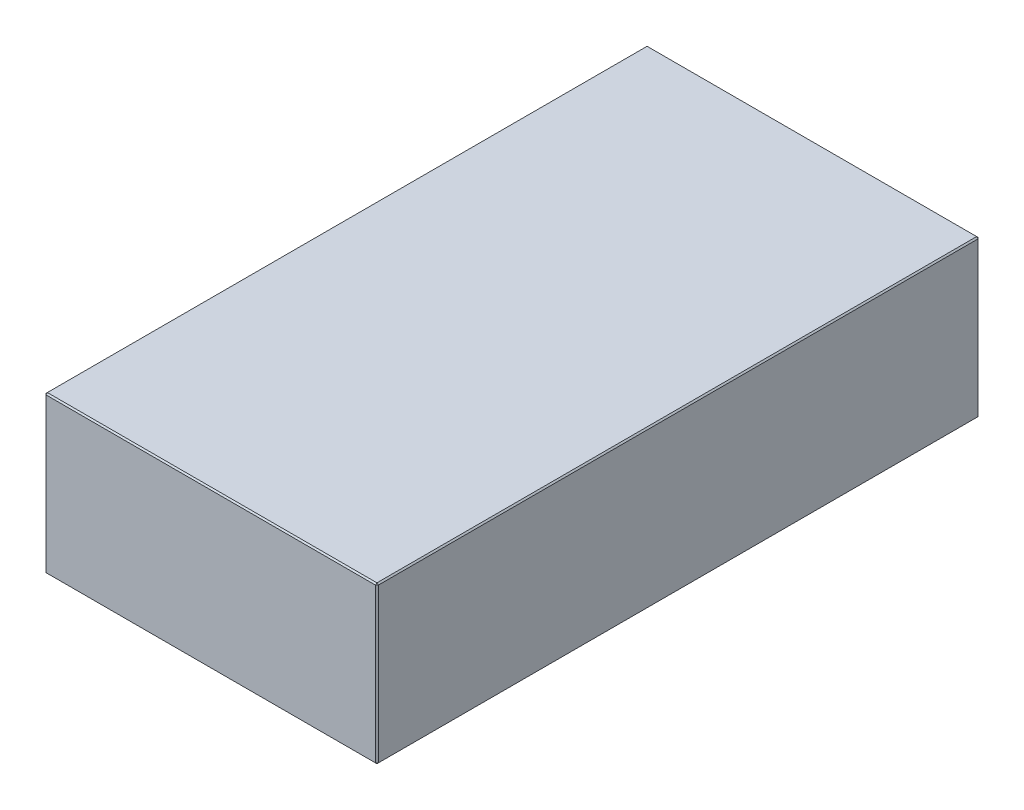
ISO-10303-21;
HEADER;
FILE_DESCRIPTION(('STEP AP214'),'2;1');
FILE_NAME('part.step','',(''),(''),'','','');
FILE_SCHEMA(('AUTOMOTIVE_DESIGN { 1 0 10303 214 1 1 1 1 }'));
ENDSEC;
DATA;
#1=APPLICATION_CONTEXT('core data for automotive mechanical design processes');
#2=APPLICATION_PROTOCOL_DEFINITION('international standard','automotive_design',2000,#1);
#3=PRODUCT_CONTEXT('',#1,'mechanical');
#4=PRODUCT('Part','Part','',(#3));
#5=PRODUCT_RELATED_PRODUCT_CATEGORY('part','',(#4));
#6=PRODUCT_DEFINITION_FORMATION('','',#4);
#7=PRODUCT_DEFINITION_CONTEXT('part definition',#1,'design');
#8=PRODUCT_DEFINITION('design','',#6,#7);
#9=PRODUCT_DEFINITION_SHAPE('','',#8);
#10=(LENGTH_UNIT() NAMED_UNIT(*) SI_UNIT(.MILLI.,.METRE.));
#11=(NAMED_UNIT(*) PLANE_ANGLE_UNIT() SI_UNIT($,.RADIAN.));
#12=(NAMED_UNIT(*) SI_UNIT($,.STERADIAN.) SOLID_ANGLE_UNIT());
#13=UNCERTAINTY_MEASURE_WITH_UNIT(LENGTH_MEASURE(1.E-05),#10,'distance_accuracy_value','');
#14=(GEOMETRIC_REPRESENTATION_CONTEXT(3) GLOBAL_UNCERTAINTY_ASSIGNED_CONTEXT((#13)) GLOBAL_UNIT_ASSIGNED_CONTEXT((#10,
#11,#12)) REPRESENTATION_CONTEXT('',''));
#15=CARTESIAN_POINT('',(0.,0.,0.));
#16=DIRECTION('',(0.,0.,1.));
#17=DIRECTION('',(1.,0.,0.));
#18=AXIS2_PLACEMENT_3D('',#15,#16,#17);
#19=CARTESIAN_POINT('',(-123.,116.,223.));
#20=DIRECTION('',(1.,0.,0.));
#21=DIRECTION('',(0.,0.,-1.));
#22=AXIS2_PLACEMENT_3D('',#19,#20,#21);
#23=PLANE('',#22);
#24=DIRECTION('',(0.,-1.,0.));
#25=VECTOR('',#24,1.);
#26=CARTESIAN_POINT('',(-123.,116.,-222.));
#27=LINE('',#26,#25);
#28=CARTESIAN_POINT('',(-123.,115.,-222.));
#29=VERTEX_POINT('',#28);
#30=CARTESIAN_POINT('',(-123.,0.999999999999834,-222.));
#31=VERTEX_POINT('',#30);
#32=EDGE_CURVE('E114',#29,#31,#27,.T.);
#33=ORIENTED_EDGE('',*,*,#32,.T.);
#34=DIRECTION('',(0.,0.,1.));
#35=VECTOR('',#34,1.);
#36=CARTESIAN_POINT('',(-123.,0.999999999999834,223.));
#37=LINE('',#36,#35);
#38=CARTESIAN_POINT('',(-123.,0.999999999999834,222.));
#39=VERTEX_POINT('',#38);
#40=EDGE_CURVE('E110',#31,#39,#37,.T.);
#41=ORIENTED_EDGE('',*,*,#40,.T.);
#42=DIRECTION('',(0.,1.,0.));
#43=VECTOR('',#42,1.);
#44=CARTESIAN_POINT('',(-123.,116.,222.));
#45=LINE('',#44,#43);
#46=CARTESIAN_POINT('',(-123.,115.,222.));
#47=VERTEX_POINT('',#46);
#48=EDGE_CURVE('E103',#39,#47,#45,.T.);
#49=ORIENTED_EDGE('',*,*,#48,.T.);
#50=DIRECTION('',(0.,0.,-1.));
#51=VECTOR('',#50,1.);
#52=CARTESIAN_POINT('',(-123.,115.,-223.));
#53=LINE('',#52,#51);
#54=EDGE_CURVE('E107',#47,#29,#53,.T.);
#55=ORIENTED_EDGE('',*,*,#54,.T.);
#56=EDGE_LOOP('',(#33,#41,#49,#55));
#57=FACE_BOUND('',#56,.T.);
#58=ADVANCED_FACE('F15',(#57),#23,.F.);
#59=CARTESIAN_POINT('',(123.,116.,223.));
#60=DIRECTION('',(0.,0.,-1.));
#61=DIRECTION('',(-1.,0.,0.));
#62=AXIS2_PLACEMENT_3D('',#59,#60,#61);
#63=PLANE('',#62);
#64=DIRECTION('',(-1.,0.,0.));
#65=VECTOR('',#64,1.);
#66=CARTESIAN_POINT('',(-123.,115.,223.));
#67=LINE('',#66,#65);
#68=CARTESIAN_POINT('',(122.,115.,223.));
#69=VERTEX_POINT('',#68);
#70=CARTESIAN_POINT('',(-122.,115.,223.));
#71=VERTEX_POINT('',#70);
#72=EDGE_CURVE('E164',#69,#71,#67,.T.);
#73=ORIENTED_EDGE('',*,*,#72,.T.);
#74=DIRECTION('',(0.,-1.,0.));
#75=VECTOR('',#74,1.);
#76=CARTESIAN_POINT('',(-122.,116.,223.));
#77=LINE('',#76,#75);
#78=CARTESIAN_POINT('',(-122.,0.999999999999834,223.));
#79=VERTEX_POINT('',#78);
#80=EDGE_CURVE('E122',#71,#79,#77,.T.);
#81=ORIENTED_EDGE('',*,*,#80,.T.);
#82=DIRECTION('',(1.,0.,0.));
#83=VECTOR('',#82,1.);
#84=CARTESIAN_POINT('',(123.,0.999999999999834,223.));
#85=LINE('',#84,#83);
#86=CARTESIAN_POINT('',(122.,0.999999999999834,223.));
#87=VERTEX_POINT('',#86);
#88=EDGE_CURVE('E168',#79,#87,#85,.T.);
#89=ORIENTED_EDGE('',*,*,#88,.T.);
#90=DIRECTION('',(0.,1.,0.));
#91=VECTOR('',#90,1.);
#92=CARTESIAN_POINT('',(122.,116.,223.));
#93=LINE('',#92,#91);
#94=EDGE_CURVE('E166',#87,#69,#93,.T.);
#95=ORIENTED_EDGE('',*,*,#94,.T.);
#96=EDGE_LOOP('',(#73,#81,#89,#95));
#97=FACE_BOUND('',#96,.T.);
#98=ADVANCED_FACE('F275',(#97),#63,.F.);
#99=CARTESIAN_POINT('',(123.,116.,223.));
#100=DIRECTION('',(-1.,0.,0.));
#101=DIRECTION('',(0.,0.,1.));
#102=AXIS2_PLACEMENT_3D('',#99,#100,#101);
#103=PLANE('',#102);
#104=DIRECTION('',(0.,0.,-1.));
#105=VECTOR('',#104,1.);
#106=CARTESIAN_POINT('',(123.,0.999999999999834,223.));
#107=LINE('',#106,#105);
#108=CARTESIAN_POINT('',(123.,0.999999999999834,222.));
#109=VERTEX_POINT('',#108);
#110=CARTESIAN_POINT('',(123.,0.999999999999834,-222.));
#111=VERTEX_POINT('',#110);
#112=EDGE_CURVE('E159',#109,#111,#107,.T.);
#113=ORIENTED_EDGE('',*,*,#112,.T.);
#114=DIRECTION('',(0.,1.,0.));
#115=VECTOR('',#114,1.);
#116=CARTESIAN_POINT('',(123.,116.,-222.));
#117=LINE('',#116,#115);
#118=CARTESIAN_POINT('',(123.,115.,-222.));
#119=VERTEX_POINT('',#118);
#120=EDGE_CURVE('E161',#111,#119,#117,.T.);
#121=ORIENTED_EDGE('',*,*,#120,.T.);
#122=DIRECTION('',(0.,0.,1.));
#123=VECTOR('',#122,1.);
#124=CARTESIAN_POINT('',(123.,115.,223.));
#125=LINE('',#124,#123);
#126=CARTESIAN_POINT('',(123.,115.,222.));
#127=VERTEX_POINT('',#126);
#128=EDGE_CURVE('E155',#119,#127,#125,.T.);
#129=ORIENTED_EDGE('',*,*,#128,.T.);
#130=DIRECTION('',(0.,-1.,0.));
#131=VECTOR('',#130,1.);
#132=CARTESIAN_POINT('',(123.,116.,222.));
#133=LINE('',#132,#131);
#134=EDGE_CURVE('E157',#127,#109,#133,.T.);
#135=ORIENTED_EDGE('',*,*,#134,.T.);
#136=EDGE_LOOP('',(#113,#121,#129,#135));
#137=FACE_BOUND('',#136,.T.);
#138=ADVANCED_FACE('F254',(#137),#103,.F.);
#139=CARTESIAN_POINT('',(123.,116.,-223.));
#140=DIRECTION('',(0.,0.,1.));
#141=DIRECTION('',(1.,0.,0.));
#142=AXIS2_PLACEMENT_3D('',#139,#140,#141);
#143=PLANE('',#142);
#144=DIRECTION('',(0.,-1.,0.));
#145=VECTOR('',#144,1.);
#146=CARTESIAN_POINT('',(122.,116.,-223.));
#147=LINE('',#146,#145);
#148=CARTESIAN_POINT('',(122.,115.,-223.));
#149=VERTEX_POINT('',#148);
#150=CARTESIAN_POINT('',(122.,0.999999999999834,-223.));
#151=VERTEX_POINT('',#150);
#152=EDGE_CURVE('E148',#149,#151,#147,.T.);
#153=ORIENTED_EDGE('',*,*,#152,.T.);
#154=DIRECTION('',(-1.,0.,0.));
#155=VECTOR('',#154,1.);
#156=CARTESIAN_POINT('',(123.,0.999999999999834,-223.));
#157=LINE('',#156,#155);
#158=CARTESIAN_POINT('',(-122.,0.999999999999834,-223.));
#159=VERTEX_POINT('',#158);
#160=EDGE_CURVE('E153',#151,#159,#157,.T.);
#161=ORIENTED_EDGE('',*,*,#160,.T.);
#162=DIRECTION('',(0.,1.,0.));
#163=VECTOR('',#162,1.);
#164=CARTESIAN_POINT('',(-122.,116.,-223.));
#165=LINE('',#164,#163);
#166=CARTESIAN_POINT('',(-122.,115.,-223.));
#167=VERTEX_POINT('',#166);
#168=EDGE_CURVE('E150',#159,#167,#165,.T.);
#169=ORIENTED_EDGE('',*,*,#168,.T.);
#170=DIRECTION('',(1.,0.,0.));
#171=VECTOR('',#170,1.);
#172=CARTESIAN_POINT('',(123.,115.,-223.));
#173=LINE('',#172,#171);
#174=EDGE_CURVE('E146',#167,#149,#173,.T.);
#175=ORIENTED_EDGE('',*,*,#174,.T.);
#176=EDGE_LOOP('',(#153,#161,#169,#175));
#177=FACE_BOUND('',#176,.T.);
#178=ADVANCED_FACE('F284',(#177),#143,.F.);
#179=CARTESIAN_POINT('',(0.,116.,0.));
#180=DIRECTION('',(0.,1.,0.));
#181=DIRECTION('',(0.,0.,1.));
#182=AXIS2_PLACEMENT_3D('',#179,#180,#181);
#183=PLANE('',#182);
#184=DIRECTION('',(0.,0.,-1.));
#185=VECTOR('',#184,1.);
#186=CARTESIAN_POINT('',(122.,116.,-223.));
#187=LINE('',#186,#185);
#188=CARTESIAN_POINT('',(122.,116.,222.));
#189=VERTEX_POINT('',#188);
#190=CARTESIAN_POINT('',(122.,116.,-222.));
#191=VERTEX_POINT('',#190);
#192=EDGE_CURVE('E24',#189,#191,#187,.T.);
#193=ORIENTED_EDGE('',*,*,#192,.T.);
#194=DIRECTION('',(-1.,0.,0.));
#195=VECTOR('',#194,1.);
#196=CARTESIAN_POINT('',(-123.,116.,-222.));
#197=LINE('',#196,#195);
#198=CARTESIAN_POINT('',(-122.,116.,-222.));
#199=VERTEX_POINT('',#198);
#200=EDGE_CURVE('E9',#191,#199,#197,.T.);
#201=ORIENTED_EDGE('',*,*,#200,.T.);
#202=DIRECTION('',(0.,0.,1.));
#203=VECTOR('',#202,1.);
#204=CARTESIAN_POINT('',(-122.,116.,223.));
#205=LINE('',#204,#203);
#206=CARTESIAN_POINT('',(-122.,116.,222.));
#207=VERTEX_POINT('',#206);
#208=EDGE_CURVE('E180',#199,#207,#205,.T.);
#209=ORIENTED_EDGE('',*,*,#208,.T.);
#210=DIRECTION('',(1.,0.,0.));
#211=VECTOR('',#210,1.);
#212=CARTESIAN_POINT('',(123.,116.,222.));
#213=LINE('',#212,#211);
#214=EDGE_CURVE('E35',#207,#189,#213,.T.);
#215=ORIENTED_EDGE('',*,*,#214,.T.);
#216=EDGE_LOOP('',(#193,#201,#209,#215));
#217=FACE_BOUND('',#216,.T.);
#218=ADVANCED_FACE('F350',(#217),#183,.T.);
#219=CARTESIAN_POINT('',(0.,0.,0.));
#220=DIRECTION('',(0.,1.,0.));
#221=DIRECTION('',(0.,0.,1.));
#222=AXIS2_PLACEMENT_3D('',#219,#220,#221);
#223=PLANE('',#222);
#224=DIRECTION('',(0.,0.,1.));
#225=VECTOR('',#224,1.);
#226=CARTESIAN_POINT('',(122.,0.,0.));
#227=LINE('',#226,#225);
#228=CARTESIAN_POINT('',(122.,0.,-222.));
#229=VERTEX_POINT('',#228);
#230=CARTESIAN_POINT('',(122.,0.,222.));
#231=VERTEX_POINT('',#230);
#232=EDGE_CURVE('E171',#229,#231,#227,.T.);
#233=ORIENTED_EDGE('',*,*,#232,.T.);
#234=DIRECTION('',(-1.,0.,0.));
#235=VECTOR('',#234,1.);
#236=CARTESIAN_POINT('',(0.,0.,222.));
#237=LINE('',#236,#235);
#238=CARTESIAN_POINT('',(-122.,0.,222.));
#239=VERTEX_POINT('',#238);
#240=EDGE_CURVE('E177',#231,#239,#237,.T.);
#241=ORIENTED_EDGE('',*,*,#240,.T.);
#242=DIRECTION('',(0.,0.,-1.));
#243=VECTOR('',#242,1.);
#244=CARTESIAN_POINT('',(-122.,0.,0.));
#245=LINE('',#244,#243);
#246=CARTESIAN_POINT('',(-122.,0.,-222.));
#247=VERTEX_POINT('',#246);
#248=EDGE_CURVE('E175',#239,#247,#245,.T.);
#249=ORIENTED_EDGE('',*,*,#248,.T.);
#250=DIRECTION('',(1.,0.,0.));
#251=VECTOR('',#250,1.);
#252=CARTESIAN_POINT('',(0.,0.,-222.));
#253=LINE('',#252,#251);
#254=EDGE_CURVE('E173',#247,#229,#253,.T.);
#255=ORIENTED_EDGE('',*,*,#254,.T.);
#256=EDGE_LOOP('',(#233,#241,#249,#255));
#257=FACE_BOUND('',#256,.T.);
#258=ADVANCED_FACE('F246',(#257),#223,.F.);
#259=CARTESIAN_POINT('',(123.,116.,222.));
#260=DIRECTION('',(-0.707106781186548,0.,-0.707106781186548));
#261=DIRECTION('',(0.,-1.,0.));
#262=AXIS2_PLACEMENT_3D('',#259,#260,#261);
#263=PLANE('',#262);
#264=DIRECTION('',(-0.707106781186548,0.,0.707106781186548));
#265=VECTOR('',#264,1.);
#266=CARTESIAN_POINT('',(122.,115.,223.));
#267=LINE('',#266,#265);
#268=EDGE_CURVE('E19',#69,#127,#267,.F.);
#269=ORIENTED_EDGE('',*,*,#268,.F.);
#270=ORIENTED_EDGE('',*,*,#94,.F.);
#271=DIRECTION('',(0.707106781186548,0.,-0.707106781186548));
#272=VECTOR('',#271,1.);
#273=CARTESIAN_POINT('',(122.,0.999999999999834,223.));
#274=LINE('',#273,#272);
#275=EDGE_CURVE('E142',#109,#87,#274,.F.);
#276=ORIENTED_EDGE('',*,*,#275,.F.);
#277=ORIENTED_EDGE('',*,*,#134,.F.);
#278=EDGE_LOOP('',(#269,#270,#276,#277));
#279=FACE_BOUND('',#278,.T.);
#280=ADVANCED_FACE('F17',(#279),#263,.F.);
#281=CARTESIAN_POINT('',(122.,115.,223.));
#282=DIRECTION('',(0.577350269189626,0.577350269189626,0.577350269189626));
#283=DIRECTION('',(0.707106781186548,0.,-0.707106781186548));
#284=AXIS2_PLACEMENT_3D('',#281,#282,#283);
#285=PLANE('',#284);
#286=DIRECTION('',(0.,-0.707106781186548,0.707106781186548));
#287=VECTOR('',#286,1.);
#288=CARTESIAN_POINT('',(122.,115.,223.));
#289=LINE('',#288,#287);
#290=EDGE_CURVE('E226',#69,#189,#289,.F.);
#291=ORIENTED_EDGE('',*,*,#290,.F.);
#292=ORIENTED_EDGE('',*,*,#268,.T.);
#293=DIRECTION('',(-0.707106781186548,0.707106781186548,0.));
#294=VECTOR('',#293,1.);
#295=CARTESIAN_POINT('',(122.5,115.5,222.));
#296=LINE('',#295,#294);
#297=EDGE_CURVE('E228',#189,#127,#296,.F.);
#298=ORIENTED_EDGE('',*,*,#297,.F.);
#299=EDGE_LOOP('',(#291,#292,#298));
#300=FACE_BOUND('',#299,.T.);
#301=ADVANCED_FACE('F270',(#300),#285,.T.);
#302=CARTESIAN_POINT('',(122.,0.999999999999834,223.));
#303=DIRECTION('',(0.577350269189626,-0.577350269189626,0.577350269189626));
#304=DIRECTION('',(0.707106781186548,0.,-0.707106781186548));
#305=AXIS2_PLACEMENT_3D('',#302,#303,#304);
#306=PLANE('',#305);
#307=DIRECTION('',(-0.707106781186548,-0.707106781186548,0.));
#308=VECTOR('',#307,1.);
#309=CARTESIAN_POINT('',(122.5,0.499999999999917,222.));
#310=LINE('',#309,#308);
#311=EDGE_CURVE('E220',#109,#231,#310,.T.);
#312=ORIENTED_EDGE('',*,*,#311,.F.);
#313=ORIENTED_EDGE('',*,*,#275,.T.);
#314=DIRECTION('',(0.,0.707106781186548,0.707106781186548));
#315=VECTOR('',#314,1.);
#316=CARTESIAN_POINT('',(122.,0.999999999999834,223.));
#317=LINE('',#316,#315);
#318=EDGE_CURVE('E223',#231,#87,#317,.T.);
#319=ORIENTED_EDGE('',*,*,#318,.F.);
#320=EDGE_LOOP('',(#312,#313,#319));
#321=FACE_BOUND('',#320,.T.);
#322=ADVANCED_FACE('F235',(#321),#306,.T.);
#323=CARTESIAN_POINT('',(122.,116.,0.));
#324=DIRECTION('',(0.707106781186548,0.707106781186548,0.));
#325=DIRECTION('',(0.,0.,1.));
#326=AXIS2_PLACEMENT_3D('',#323,#324,#325);
#327=PLANE('',#326);
#328=ORIENTED_EDGE('',*,*,#297,.T.);
#329=ORIENTED_EDGE('',*,*,#128,.F.);
#330=DIRECTION('',(0.707106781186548,-0.707106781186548,0.));
#331=VECTOR('',#330,1.);
#332=CARTESIAN_POINT('',(123.,115.,-222.));
#333=LINE('',#332,#331);
#334=EDGE_CURVE('E215',#191,#119,#333,.T.);
#335=ORIENTED_EDGE('',*,*,#334,.F.);
#336=ORIENTED_EDGE('',*,*,#192,.F.);
#337=EDGE_LOOP('',(#328,#329,#335,#336));
#338=FACE_BOUND('',#337,.T.);
#339=ADVANCED_FACE('F265',(#338),#327,.T.);
#340=CARTESIAN_POINT('',(0.,116.,222.));
#341=DIRECTION('',(0.,0.707106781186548,0.707106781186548));
#342=DIRECTION('',(-1.,0.,0.));
#343=AXIS2_PLACEMENT_3D('',#340,#341,#342);
#344=PLANE('',#343);
#345=ORIENTED_EDGE('',*,*,#290,.T.);
#346=ORIENTED_EDGE('',*,*,#214,.F.);
#347=DIRECTION('',(0.,0.707106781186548,-0.707106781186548));
#348=VECTOR('',#347,1.);
#349=CARTESIAN_POINT('',(-122.,115.5,222.5));
#350=LINE('',#349,#348);
#351=EDGE_CURVE('E126',#71,#207,#350,.T.);
#352=ORIENTED_EDGE('',*,*,#351,.F.);
#353=ORIENTED_EDGE('',*,*,#72,.F.);
#354=EDGE_LOOP('',(#345,#346,#352,#353));
#355=FACE_BOUND('',#354,.T.);
#356=ADVANCED_FACE('F273',(#355),#344,.T.);
#357=CARTESIAN_POINT('',(-122.,116.,223.));
#358=DIRECTION('',(0.707106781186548,0.,-0.707106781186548));
#359=DIRECTION('',(0.,-1.,0.));
#360=AXIS2_PLACEMENT_3D('',#357,#358,#359);
#361=PLANE('',#360);
#362=DIRECTION('',(0.707106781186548,0.,0.707106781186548));
#363=VECTOR('',#362,1.);
#364=CARTESIAN_POINT('',(-122.,0.999999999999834,223.));
#365=LINE('',#364,#363);
#366=EDGE_CURVE('E127',#79,#39,#365,.F.);
#367=ORIENTED_EDGE('',*,*,#366,.F.);
#368=ORIENTED_EDGE('',*,*,#80,.F.);
#369=DIRECTION('',(-0.707106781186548,0.,-0.707106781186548));
#370=VECTOR('',#369,1.);
#371=CARTESIAN_POINT('',(-123.,115.,222.));
#372=LINE('',#371,#370);
#373=EDGE_CURVE('E118',#47,#71,#372,.F.);
#374=ORIENTED_EDGE('',*,*,#373,.F.);
#375=ORIENTED_EDGE('',*,*,#48,.F.);
#376=EDGE_LOOP('',(#367,#368,#374,#375));
#377=FACE_BOUND('',#376,.T.);
#378=ADVANCED_FACE('F120',(#377),#361,.F.);
#379=CARTESIAN_POINT('',(123.,0.999999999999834,223.));
#380=DIRECTION('',(0.,0.707106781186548,-0.707106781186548));
#381=DIRECTION('',(1.,0.,0.));
#382=AXIS2_PLACEMENT_3D('',#379,#380,#381);
#383=PLANE('',#382);
#384=ORIENTED_EDGE('',*,*,#318,.T.);
#385=ORIENTED_EDGE('',*,*,#88,.F.);
#386=DIRECTION('',(0.,-0.707106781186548,-0.707106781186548));
#387=VECTOR('',#386,1.);
#388=CARTESIAN_POINT('',(-122.,0.999999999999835,223.));
#389=LINE('',#388,#387);
#390=EDGE_CURVE('E211',#239,#79,#389,.F.);
#391=ORIENTED_EDGE('',*,*,#390,.F.);
#392=ORIENTED_EDGE('',*,*,#240,.F.);
#393=EDGE_LOOP('',(#384,#385,#391,#392));
#394=FACE_BOUND('',#393,.T.);
#395=ADVANCED_FACE('F243',(#394),#383,.F.);
#396=CARTESIAN_POINT('',(123.,0.999999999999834,223.));
#397=DIRECTION('',(-0.707106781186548,0.707106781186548,0.));
#398=DIRECTION('',(0.,0.,-1.));
#399=AXIS2_PLACEMENT_3D('',#396,#397,#398);
#400=PLANE('',#399);
#401=ORIENTED_EDGE('',*,*,#311,.T.);
#402=ORIENTED_EDGE('',*,*,#232,.F.);
#403=DIRECTION('',(0.707106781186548,0.707106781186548,0.));
#404=VECTOR('',#403,1.);
#405=CARTESIAN_POINT('',(122.5,0.499999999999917,-222.));
#406=LINE('',#405,#404);
#407=EDGE_CURVE('E208',#111,#229,#406,.F.);
#408=ORIENTED_EDGE('',*,*,#407,.F.);
#409=ORIENTED_EDGE('',*,*,#112,.F.);
#410=EDGE_LOOP('',(#401,#402,#408,#409));
#411=FACE_BOUND('',#410,.T.);
#412=ADVANCED_FACE('F251',(#411),#400,.F.);
#413=CARTESIAN_POINT('',(122.,116.,-223.));
#414=DIRECTION('',(-0.707106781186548,0.,0.707106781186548));
#415=DIRECTION('',(0.,-1.,0.));
#416=AXIS2_PLACEMENT_3D('',#413,#414,#415);
#417=PLANE('',#416);
#418=DIRECTION('',(0.707106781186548,0.,0.707106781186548));
#419=VECTOR('',#418,1.);
#420=CARTESIAN_POINT('',(123.,115.,-222.));
#421=LINE('',#420,#419);
#422=EDGE_CURVE('E217',#119,#149,#421,.F.);
#423=ORIENTED_EDGE('',*,*,#422,.F.);
#424=ORIENTED_EDGE('',*,*,#120,.F.);
#425=DIRECTION('',(-0.707106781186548,0.,-0.707106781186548));
#426=VECTOR('',#425,1.);
#427=CARTESIAN_POINT('',(122.,0.999999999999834,-223.));
#428=LINE('',#427,#426);
#429=EDGE_CURVE('E205',#151,#111,#428,.F.);
#430=ORIENTED_EDGE('',*,*,#429,.F.);
#431=ORIENTED_EDGE('',*,*,#152,.F.);
#432=EDGE_LOOP('',(#423,#424,#430,#431));
#433=FACE_BOUND('',#432,.T.);
#434=ADVANCED_FACE('F258',(#433),#417,.F.);
#435=CARTESIAN_POINT('',(123.,115.,-222.));
#436=DIRECTION('',(0.577350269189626,0.577350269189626,-0.577350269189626));
#437=DIRECTION('',(-0.707106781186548,0.,-0.707106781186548));
#438=AXIS2_PLACEMENT_3D('',#435,#436,#437);
#439=PLANE('',#438);
#440=ORIENTED_EDGE('',*,*,#334,.T.);
#441=ORIENTED_EDGE('',*,*,#422,.T.);
#442=DIRECTION('',(0.,0.707106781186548,0.707106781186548));
#443=VECTOR('',#442,1.);
#444=CARTESIAN_POINT('',(122.,115.5,-222.5));
#445=LINE('',#444,#443);
#446=EDGE_CURVE('E134',#191,#149,#445,.F.);
#447=ORIENTED_EDGE('',*,*,#446,.F.);
#448=EDGE_LOOP('',(#440,#441,#447));
#449=FACE_BOUND('',#448,.T.);
#450=ADVANCED_FACE('F325',(#449),#439,.T.);
#451=CARTESIAN_POINT('',(-123.,115.,222.));
#452=DIRECTION('',(-0.577350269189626,0.577350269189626,0.577350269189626));
#453=DIRECTION('',(0.707106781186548,0.,0.707106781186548));
#454=AXIS2_PLACEMENT_3D('',#451,#452,#453);
#455=PLANE('',#454);
#456=ORIENTED_EDGE('',*,*,#373,.T.);
#457=ORIENTED_EDGE('',*,*,#351,.T.);
#458=DIRECTION('',(-0.707106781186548,-0.707106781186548,0.));
#459=VECTOR('',#458,1.);
#460=CARTESIAN_POINT('',(-123.,115.,222.));
#461=LINE('',#460,#459);
#462=EDGE_CURVE('E130',#47,#207,#461,.F.);
#463=ORIENTED_EDGE('',*,*,#462,.F.);
#464=EDGE_LOOP('',(#456,#457,#463));
#465=FACE_BOUND('',#464,.T.);
#466=ADVANCED_FACE('F131',(#465),#455,.T.);
#467=CARTESIAN_POINT('',(-122.,0.999999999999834,223.));
#468=DIRECTION('',(-0.577350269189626,-0.577350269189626,0.577350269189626));
#469=DIRECTION('',(0.707106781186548,0.,0.707106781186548));
#470=AXIS2_PLACEMENT_3D('',#467,#468,#469);
#471=PLANE('',#470);
#472=ORIENTED_EDGE('',*,*,#390,.T.);
#473=ORIENTED_EDGE('',*,*,#366,.T.);
#474=DIRECTION('',(-0.707106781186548,0.707106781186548,0.));
#475=VECTOR('',#474,1.);
#476=CARTESIAN_POINT('',(-122.5,0.499999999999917,222.));
#477=LINE('',#476,#475);
#478=EDGE_CURVE('E135',#239,#39,#477,.T.);
#479=ORIENTED_EDGE('',*,*,#478,.F.);
#480=EDGE_LOOP('',(#472,#473,#479));
#481=FACE_BOUND('',#480,.T.);
#482=ADVANCED_FACE('F318',(#481),#471,.T.);
#483=CARTESIAN_POINT('',(122.,0.999999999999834,-223.));
#484=DIRECTION('',(0.577350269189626,-0.577350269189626,-0.577350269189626));
#485=DIRECTION('',(-0.707106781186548,0.,-0.707106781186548));
#486=AXIS2_PLACEMENT_3D('',#483,#484,#485);
#487=PLANE('',#486);
#488=ORIENTED_EDGE('',*,*,#429,.T.);
#489=ORIENTED_EDGE('',*,*,#407,.T.);
#490=DIRECTION('',(0.,-0.707106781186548,0.707106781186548));
#491=VECTOR('',#490,1.);
#492=CARTESIAN_POINT('',(122.,0.999999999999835,-223.));
#493=LINE('',#492,#491);
#494=EDGE_CURVE('E198',#151,#229,#493,.T.);
#495=ORIENTED_EDGE('',*,*,#494,.F.);
#496=EDGE_LOOP('',(#488,#489,#495));
#497=FACE_BOUND('',#496,.T.);
#498=ADVANCED_FACE('F314',(#497),#487,.T.);
#499=CARTESIAN_POINT('',(0.,116.,-222.));
#500=DIRECTION('',(0.,0.707106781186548,-0.707106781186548));
#501=DIRECTION('',(1.,0.,0.));
#502=AXIS2_PLACEMENT_3D('',#499,#500,#501);
#503=PLANE('',#502);
#504=ORIENTED_EDGE('',*,*,#446,.T.);
#505=ORIENTED_EDGE('',*,*,#174,.F.);
#506=DIRECTION('',(0.,-0.707106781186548,-0.707106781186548));
#507=VECTOR('',#506,1.);
#508=CARTESIAN_POINT('',(-122.,115.,-223.));
#509=LINE('',#508,#507);
#510=EDGE_CURVE('E195',#199,#167,#509,.T.);
#511=ORIENTED_EDGE('',*,*,#510,.F.);
#512=ORIENTED_EDGE('',*,*,#200,.F.);
#513=EDGE_LOOP('',(#504,#505,#511,#512));
#514=FACE_BOUND('',#513,.T.);
#515=ADVANCED_FACE('F311',(#514),#503,.T.);
#516=CARTESIAN_POINT('',(-122.,116.,0.));
#517=DIRECTION('',(-0.707106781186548,0.707106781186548,0.));
#518=DIRECTION('',(0.,0.,-1.));
#519=AXIS2_PLACEMENT_3D('',#516,#517,#518);
#520=PLANE('',#519);
#521=ORIENTED_EDGE('',*,*,#462,.T.);
#522=ORIENTED_EDGE('',*,*,#208,.F.);
#523=DIRECTION('',(0.707106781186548,0.707106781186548,0.));
#524=VECTOR('',#523,1.);
#525=CARTESIAN_POINT('',(-122.5,115.5,-222.));
#526=LINE('',#525,#524);
#527=EDGE_CURVE('E138',#29,#199,#526,.T.);
#528=ORIENTED_EDGE('',*,*,#527,.F.);
#529=ORIENTED_EDGE('',*,*,#54,.F.);
#530=EDGE_LOOP('',(#521,#522,#528,#529));
#531=FACE_BOUND('',#530,.T.);
#532=ADVANCED_FACE('F137',(#531),#520,.T.);
#533=CARTESIAN_POINT('',(-123.,0.999999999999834,223.));
#534=DIRECTION('',(0.707106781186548,0.707106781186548,0.));
#535=DIRECTION('',(0.,0.,1.));
#536=AXIS2_PLACEMENT_3D('',#533,#534,#535);
#537=PLANE('',#536);
#538=ORIENTED_EDGE('',*,*,#478,.T.);
#539=ORIENTED_EDGE('',*,*,#40,.F.);
#540=DIRECTION('',(0.707106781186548,-0.707106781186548,0.));
#541=VECTOR('',#540,1.);
#542=CARTESIAN_POINT('',(-123.,0.999999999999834,-222.));
#543=LINE('',#542,#541);
#544=EDGE_CURVE('E191',#247,#31,#543,.F.);
#545=ORIENTED_EDGE('',*,*,#544,.F.);
#546=ORIENTED_EDGE('',*,*,#248,.F.);
#547=EDGE_LOOP('',(#538,#539,#545,#546));
#548=FACE_BOUND('',#547,.T.);
#549=ADVANCED_FACE('F304',(#548),#537,.F.);
#550=CARTESIAN_POINT('',(123.,0.999999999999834,-223.));
#551=DIRECTION('',(0.,0.707106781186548,0.707106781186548));
#552=DIRECTION('',(-1.,0.,0.));
#553=AXIS2_PLACEMENT_3D('',#550,#551,#552);
#554=PLANE('',#553);
#555=ORIENTED_EDGE('',*,*,#494,.T.);
#556=ORIENTED_EDGE('',*,*,#254,.F.);
#557=DIRECTION('',(0.,0.707106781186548,-0.707106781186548));
#558=VECTOR('',#557,1.);
#559=CARTESIAN_POINT('',(-122.,0.499999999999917,-222.5));
#560=LINE('',#559,#558);
#561=EDGE_CURVE('E188',#159,#247,#560,.F.);
#562=ORIENTED_EDGE('',*,*,#561,.F.);
#563=ORIENTED_EDGE('',*,*,#160,.F.);
#564=EDGE_LOOP('',(#555,#556,#562,#563));
#565=FACE_BOUND('',#564,.T.);
#566=ADVANCED_FACE('F300',(#565),#554,.F.);
#567=CARTESIAN_POINT('',(-122.,115.,-223.));
#568=DIRECTION('',(-0.577350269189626,0.577350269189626,-0.577350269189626));
#569=DIRECTION('',(-0.707106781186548,0.,0.707106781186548));
#570=AXIS2_PLACEMENT_3D('',#567,#568,#569);
#571=PLANE('',#570);
#572=ORIENTED_EDGE('',*,*,#527,.T.);
#573=ORIENTED_EDGE('',*,*,#510,.T.);
#574=DIRECTION('',(0.707106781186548,0.,-0.707106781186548));
#575=VECTOR('',#574,1.);
#576=CARTESIAN_POINT('',(-122.,115.,-223.));
#577=LINE('',#576,#575);
#578=EDGE_CURVE('E186',#29,#167,#577,.T.);
#579=ORIENTED_EDGE('',*,*,#578,.F.);
#580=EDGE_LOOP('',(#572,#573,#579));
#581=FACE_BOUND('',#580,.T.);
#582=ADVANCED_FACE('F296',(#581),#571,.T.);
#583=CARTESIAN_POINT('',(-123.,0.999999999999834,-222.));
#584=DIRECTION('',(-0.577350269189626,-0.577350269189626,-0.577350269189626));
#585=DIRECTION('',(-0.707106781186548,0.,0.707106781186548));
#586=AXIS2_PLACEMENT_3D('',#583,#584,#585);
#587=PLANE('',#586);
#588=ORIENTED_EDGE('',*,*,#561,.T.);
#589=ORIENTED_EDGE('',*,*,#544,.T.);
#590=DIRECTION('',(-0.707106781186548,0.,0.707106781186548));
#591=VECTOR('',#590,1.);
#592=CARTESIAN_POINT('',(-123.,0.999999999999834,-222.));
#593=LINE('',#592,#591);
#594=EDGE_CURVE('E184',#159,#31,#593,.T.);
#595=ORIENTED_EDGE('',*,*,#594,.F.);
#596=EDGE_LOOP('',(#588,#589,#595));
#597=FACE_BOUND('',#596,.T.);
#598=ADVANCED_FACE('F292',(#597),#587,.T.);
#599=CARTESIAN_POINT('',(-123.,116.,-222.));
#600=DIRECTION('',(0.707106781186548,0.,0.707106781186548));
#601=DIRECTION('',(0.,-1.,0.));
#602=AXIS2_PLACEMENT_3D('',#599,#600,#601);
#603=PLANE('',#602);
#604=ORIENTED_EDGE('',*,*,#578,.T.);
#605=ORIENTED_EDGE('',*,*,#168,.F.);
#606=ORIENTED_EDGE('',*,*,#594,.T.);
#607=ORIENTED_EDGE('',*,*,#32,.F.);
#608=EDGE_LOOP('',(#604,#605,#606,#607));
#609=FACE_BOUND('',#608,.T.);
#610=ADVANCED_FACE('F289',(#609),#603,.F.);
#611=CLOSED_SHELL('',(#58,#98,#138,#178,#218,#258,#280,#301,#322,#339,#356,#378,#395,#412,#434,
#450,#466,#482,#498,#515,#532,#549,#566,#582,#598,#610));
#612=MANIFOLD_SOLID_BREP('B1',#611);
#613=ADVANCED_BREP_SHAPE_REPRESENTATION('',(#18,#612),#14);
#614=SHAPE_DEFINITION_REPRESENTATION(#9,#613);
ENDSEC;
END-ISO-10303-21;
